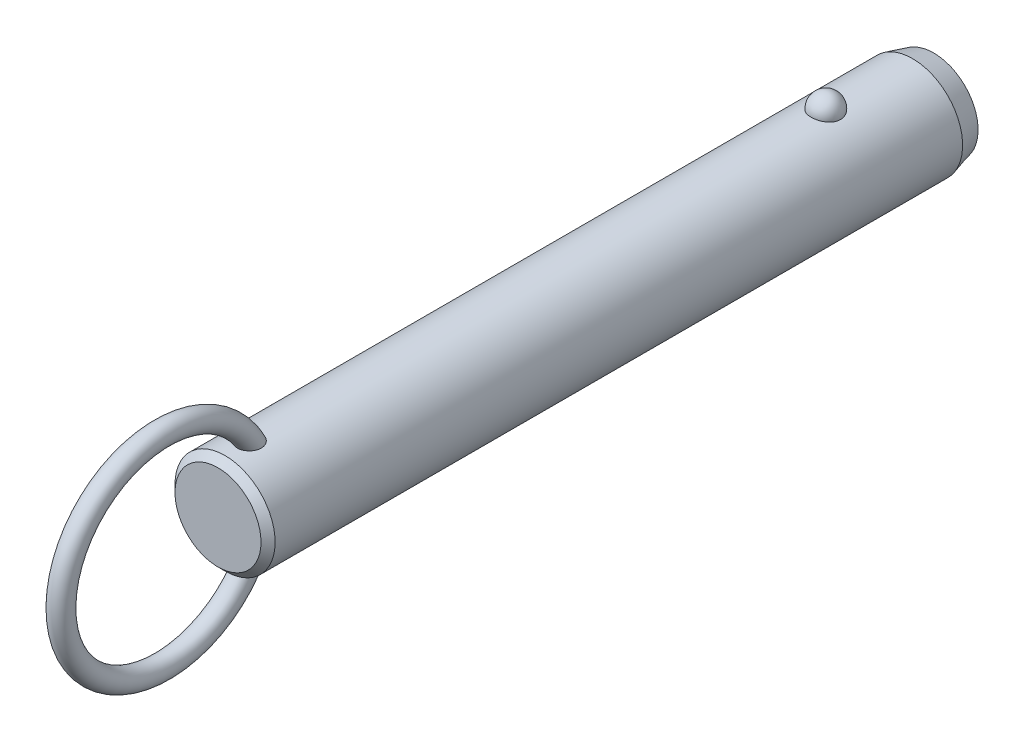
ISO-10303-21;
HEADER;
FILE_DESCRIPTION(('STEP AP214'),'2;1');
FILE_NAME('part.step','',(''),(''),'','','');
FILE_SCHEMA(('AUTOMOTIVE_DESIGN { 1 0 10303 214 1 1 1 1 }'));
ENDSEC;
DATA;
#1=APPLICATION_CONTEXT('core data for automotive mechanical design processes');
#2=APPLICATION_PROTOCOL_DEFINITION('international standard','automotive_design',2000,#1);
#3=PRODUCT_CONTEXT('',#1,'mechanical');
#4=PRODUCT('Part','Part','',(#3));
#5=PRODUCT_RELATED_PRODUCT_CATEGORY('part','',(#4));
#6=PRODUCT_DEFINITION_FORMATION('','',#4);
#7=PRODUCT_DEFINITION_CONTEXT('part definition',#1,'design');
#8=PRODUCT_DEFINITION('design','',#6,#7);
#9=PRODUCT_DEFINITION_SHAPE('','',#8);
#10=(LENGTH_UNIT() NAMED_UNIT(*) SI_UNIT(.MILLI.,.METRE.));
#11=(NAMED_UNIT(*) PLANE_ANGLE_UNIT() SI_UNIT($,.RADIAN.));
#12=(NAMED_UNIT(*) SI_UNIT($,.STERADIAN.) SOLID_ANGLE_UNIT());
#13=UNCERTAINTY_MEASURE_WITH_UNIT(LENGTH_MEASURE(1.E-05),#10,'distance_accuracy_value','');
#14=(GEOMETRIC_REPRESENTATION_CONTEXT(3) GLOBAL_UNCERTAINTY_ASSIGNED_CONTEXT((#13)) GLOBAL_UNIT_ASSIGNED_CONTEXT((#10,
#11,#12)) REPRESENTATION_CONTEXT('',''));
#15=CARTESIAN_POINT('',(0.,0.,0.));
#16=DIRECTION('',(0.,0.,1.));
#17=DIRECTION('',(1.,0.,0.));
#18=AXIS2_PLACEMENT_3D('',#15,#16,#17);
#19=CARTESIAN_POINT('',(0.,0.,76.2));
#20=DIRECTION('',(0.,0.,-1.));
#21=DIRECTION('',(-1.,0.,0.));
#22=AXIS2_PLACEMENT_3D('',#19,#20,#21);
#23=CYLINDRICAL_SURFACE('',#22,7.1);
#24=CARTESIAN_POINT('',(2.0769088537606,6.78943661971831,-2.1));
#25=CARTESIAN_POINT('',(2.07690739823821,6.78943796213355,-1.98268154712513));
#26=CARTESIAN_POINT('',(2.06738130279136,6.79237331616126,-1.86534506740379));
#27=CARTESIAN_POINT('',(2.0295040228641,6.8037853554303,-1.63400788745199));
#28=CARTESIAN_POINT('',(2.00114757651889,6.81226358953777,-1.52000812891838));
#29=CARTESIAN_POINT('',(1.92632025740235,6.83379798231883,-1.29863433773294));
#30=CARTESIAN_POINT('',(1.87985726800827,6.84685214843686,-1.19125744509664));
#31=CARTESIAN_POINT('',(1.76995205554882,6.87608091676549,-0.986046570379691));
#32=CARTESIAN_POINT('',(1.70650980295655,6.8922555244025,-0.888212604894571));
#33=CARTESIAN_POINT('',(1.56381192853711,6.92602930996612,-0.704242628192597));
#34=CARTESIAN_POINT('',(1.4844714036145,6.94363582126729,-0.618173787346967));
#35=CARTESIAN_POINT('',(1.31221746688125,6.97823658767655,-0.460740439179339));
#36=CARTESIAN_POINT('',(1.21930409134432,6.99523084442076,-0.389375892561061));
#37=CARTESIAN_POINT('',(1.02268781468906,7.02666176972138,-0.263547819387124));
#38=CARTESIAN_POINT('',(0.919020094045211,7.04110638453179,-0.209031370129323));
#39=CARTESIAN_POINT('',(0.703548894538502,7.06588726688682,-0.118163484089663));
#40=CARTESIAN_POINT('',(0.591746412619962,7.07622403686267,-0.0818098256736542));
#41=CARTESIAN_POINT('',(0.365557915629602,7.09147068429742,-0.028871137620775));
#42=CARTESIAN_POINT('',(0.251267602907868,7.09648447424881,-0.0119070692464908));
#43=CARTESIAN_POINT('',(0.0213499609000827,7.10089837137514,0.00304925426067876));
#44=CARTESIAN_POINT('',(-0.0942772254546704,7.10029907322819,0.00104351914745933));
#45=CARTESIAN_POINT('',(-0.321651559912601,7.09360829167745,-0.0216931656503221));
#46=CARTESIAN_POINT('',(-0.433431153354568,7.08760388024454,-0.0421272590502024));
#47=CARTESIAN_POINT('',(-0.651862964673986,7.07086131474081,-0.100729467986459));
#48=CARTESIAN_POINT('',(-0.758515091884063,7.06012307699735,-0.138897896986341));
#49=CARTESIAN_POINT('',(-0.964449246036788,7.03496097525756,-0.232213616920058));
#50=CARTESIAN_POINT('',(-1.06368095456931,7.02051445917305,-0.287465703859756));
#51=CARTESIAN_POINT('',(-1.25145353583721,6.98948740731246,-0.413383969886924));
#52=CARTESIAN_POINT('',(-1.33999321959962,6.97290663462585,-0.484051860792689));
#53=CARTESIAN_POINT('',(-1.50591604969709,6.93898770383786,-0.640594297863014));
#54=CARTESIAN_POINT('',(-1.58302488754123,6.92164094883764,-0.726757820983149));
#55=CARTESIAN_POINT('',(-1.72189320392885,6.8884103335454,-0.910927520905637));
#56=CARTESIAN_POINT('',(-1.78365144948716,6.87252659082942,-1.008934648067));
#57=CARTESIAN_POINT('',(-1.89101272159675,6.84377189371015,-1.21549497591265));
#58=CARTESIAN_POINT('',(-1.93639553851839,6.83094274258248,-1.32416860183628));
#59=CARTESIAN_POINT('',(-2.00874275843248,6.81002070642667,-1.54791500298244));
#60=CARTESIAN_POINT('',(-2.03570774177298,6.80192767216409,-1.66298757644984));
#61=CARTESIAN_POINT('',(-2.07047276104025,6.7914266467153,-1.89571453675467));
#62=CARTESIAN_POINT('',(-2.07835878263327,6.78899315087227,-2.01335491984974));
#63=CARTESIAN_POINT('',(-2.07502083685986,6.79001409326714,-2.24833570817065));
#64=CARTESIAN_POINT('',(-2.06379746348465,6.7934683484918,-2.36567612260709));
#65=CARTESIAN_POINT('',(-2.02263913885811,6.80583442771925,-2.59603194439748));
#66=CARTESIAN_POINT('',(-1.99281127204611,6.81471501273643,-2.70906820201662));
#67=CARTESIAN_POINT('',(-1.91526639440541,6.83691232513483,-2.92836575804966));
#68=CARTESIAN_POINT('',(-1.8675486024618,6.85022924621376,-3.03462676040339));
#69=CARTESIAN_POINT('',(-1.75504492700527,6.87991336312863,-3.23806487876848));
#70=CARTESIAN_POINT('',(-1.69015924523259,6.89629822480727,-3.33518422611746));
#71=CARTESIAN_POINT('',(-1.54505404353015,6.93024852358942,-3.51697105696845));
#72=CARTESIAN_POINT('',(-1.46483385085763,6.94781401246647,-3.60163799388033));
#73=CARTESIAN_POINT('',(-1.29071406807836,6.98225977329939,-3.75654119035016));
#74=CARTESIAN_POINT('',(-1.19675650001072,6.99913673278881,-3.82671308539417));
#75=CARTESIAN_POINT('',(-0.997940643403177,7.03023618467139,-3.9501837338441));
#76=CARTESIAN_POINT('',(-0.893083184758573,7.04445887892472,-4.00348377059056));
#77=CARTESIAN_POINT('',(-0.676902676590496,7.06848365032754,-4.09107242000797));
#78=CARTESIAN_POINT('',(-0.565686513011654,7.0783430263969,-4.12560889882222));
#79=CARTESIAN_POINT('',(-0.338739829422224,7.09282534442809,-4.17575450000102));
#80=CARTESIAN_POINT('',(-0.223009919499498,7.09744899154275,-4.19136617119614));
#81=CARTESIAN_POINT('',(0.00707628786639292,7.10090930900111,-4.20307965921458));
#82=CARTESIAN_POINT('',(0.121410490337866,7.09986531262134,-4.19958377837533));
#83=CARTESIAN_POINT('',(0.34781544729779,7.092380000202,-4.17411564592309));
#84=CARTESIAN_POINT('',(0.459886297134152,7.08593891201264,-4.15214417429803));
#85=CARTESIAN_POINT('',(0.678084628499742,7.06838983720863,-4.09049562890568));
#86=CARTESIAN_POINT('',(0.784237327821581,7.05730369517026,-4.05090137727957));
#87=CARTESIAN_POINT('',(0.988305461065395,7.03163139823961,-3.95511447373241));
#88=CARTESIAN_POINT('',(1.08622031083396,7.01704499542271,-3.89892064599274));
#89=CARTESIAN_POINT('',(1.27284490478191,6.98562668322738,-3.77035541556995));
#90=CARTESIAN_POINT('',(1.36137372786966,6.96876135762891,-3.69772964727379));
#91=CARTESIAN_POINT('',(1.52509486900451,6.93477412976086,-3.53878279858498));
#92=CARTESIAN_POINT('',(1.60028496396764,6.91765218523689,-3.45245943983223));
#93=CARTESIAN_POINT('',(1.73681688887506,6.88465753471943,-3.26658774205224));
#94=CARTESIAN_POINT('',(1.79785966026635,6.86881574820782,-3.16681408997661));
#95=CARTESIAN_POINT('',(1.90265327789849,6.84053157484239,-2.95814408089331));
#96=CARTESIAN_POINT('',(1.94640861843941,6.82808830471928,-2.84925010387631));
#97=CARTESIAN_POINT('',(2.01274378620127,6.80881460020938,-2.63454318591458));
#98=CARTESIAN_POINT('',(2.03676193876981,6.80160856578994,-2.52920574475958));
#99=CARTESIAN_POINT('',(2.06884490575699,6.79191902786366,-2.3159172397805));
#100=CARTESIAN_POINT('',(2.07691019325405,6.78943538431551,-2.20796625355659));
#101=CARTESIAN_POINT('',(2.0769088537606,6.78943661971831,-2.1));
#102=B_SPLINE_CURVE_WITH_KNOTS('',3,(#24,#25,#26,#27,#28,#29,#30,#31,#32,#33,#34,#35,#36,#37,
#38,#39,#40,#41,#42,#43,#44,#45,#46,#47,#48,#49,#50,#51,#52,#53,#54,#55,#56,#57,#58,#59,#60,#61,
#62,#63,#64,#65,#66,#67,#68,#69,#70,#71,#72,#73,#74,#75,#76,#77,#78,#79,#80,#81,#82,#83,#84,#85,
#86,#87,#88,#89,#90,#91,#92,#93,#94,#95,#96,#97,#98,#99,#100,#101),.UNSPECIFIED.,.T.,.F.,(4,2,2,
2,2,2,2,2,2,2,2,2,2,2,2,2,2,2,2,2,2,2,2,2,2,2,2,2,2,2,2,2,2,2,2,2,2,2,4),(0.,0.351568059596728,
0.703234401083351,1.05474780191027,1.40626181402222,1.75970563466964,2.11314851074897,
2.4654696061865,2.81774759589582,3.16301449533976,3.50824481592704,3.84801136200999,
4.18778391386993,4.52968352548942,4.87162112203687,5.22076181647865,5.56993054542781,
5.92363364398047,6.27732559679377,6.62942052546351,6.98150450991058,7.33158042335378,
7.68167162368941,8.03384443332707,8.38603269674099,8.73975272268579,9.09344583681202,
9.44234545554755,9.79119807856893,10.1327344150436,10.4742563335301,10.8141898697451,
11.1541474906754,11.4997793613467,11.8454687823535,12.1979079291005,12.5502553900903,
12.8738073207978,13.1973496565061),.UNSPECIFIED.);
#103=CARTESIAN_POINT('',(2.0769088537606,6.78943661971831,-2.1));
#104=VERTEX_POINT('',#103);
#105=EDGE_CURVE('E41',#104,#104,#102,.T.);
#106=ORIENTED_EDGE('',*,*,#105,.T.);
#107=EDGE_LOOP('',(#106));
#108=FACE_BOUND('',#107,.T.);
#109=CARTESIAN_POINT('',(0.,0.,83.1200000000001));
#110=DIRECTION('',(0.,0.,1.));
#111=DIRECTION('',(1.,0.,0.));
#112=AXIS2_PLACEMENT_3D('',#109,#110,#111);
#113=CIRCLE('',#112,7.1);
#114=CARTESIAN_POINT('',(7.1,0.,83.1200000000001));
#115=VERTEX_POINT('',#114);
#116=EDGE_CURVE('E10',#115,#115,#113,.F.);
#117=ORIENTED_EDGE('',*,*,#116,.T.);
#118=EDGE_LOOP('',(#117));
#119=FACE_BOUND('',#118,.T.);
#120=CARTESIAN_POINT('',(-0.429539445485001,-7.08699541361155,77.9429212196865));
#121=CARTESIAN_POINT('',(-0.508331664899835,-7.08221999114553,77.9668764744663));
#122=CARTESIAN_POINT('',(-0.585039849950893,-7.07624016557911,77.9974570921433));
#123=CARTESIAN_POINT('',(-0.732082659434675,-7.06254296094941,78.0710242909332));
#124=CARTESIAN_POINT('',(-0.802417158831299,-7.05482554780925,78.1140111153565));
#125=CARTESIAN_POINT('',(-0.934722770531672,-7.03851844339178,78.2111135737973));
#126=CARTESIAN_POINT('',(-0.996700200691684,-7.02992941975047,78.2652207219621));
#127=CARTESIAN_POINT('',(-1.11079942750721,-7.01280697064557,78.3829676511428));
#128=CARTESIAN_POINT('',(-1.16292136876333,-7.00427354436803,78.4466072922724));
#129=CARTESIAN_POINT('',(-1.25705660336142,-6.98799959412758,78.5826870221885));
#130=CARTESIAN_POINT('',(-1.2988803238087,-6.98027525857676,78.6552598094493));
#131=CARTESIAN_POINT('',(-1.37069920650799,-6.96652886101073,78.8061686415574));
#132=CARTESIAN_POINT('',(-1.40069157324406,-6.96050720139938,78.8845060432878));
#133=CARTESIAN_POINT('',(-1.45043507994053,-6.95031881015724,79.0501903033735));
#134=CARTESIAN_POINT('',(-1.46937115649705,-6.94630231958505,79.1377897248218));
#135=CARTESIAN_POINT('',(-1.49424917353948,-6.94099239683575,79.3148714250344));
#136=CARTESIAN_POINT('',(-1.50018601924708,-6.93970003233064,79.4043544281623));
#137=CARTESIAN_POINT('',(-1.49978214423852,-6.93978815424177,79.5940607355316));
#138=CARTESIAN_POINT('',(-1.49187639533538,-6.94150934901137,79.694279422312));
#139=CARTESIAN_POINT('',(-1.46177925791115,-6.94790814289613,79.8924798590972));
#140=CARTESIAN_POINT('',(-1.43957541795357,-6.95258831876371,79.990459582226));
#141=CARTESIAN_POINT('',(-1.37783293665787,-6.96510647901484,80.1953629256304));
#142=CARTESIAN_POINT('',(-1.33634073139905,-6.97328848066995,80.3016801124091));
#143=CARTESIAN_POINT('',(-1.23686994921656,-6.99161706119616,80.5061777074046));
#144=CARTESIAN_POINT('',(-1.17889192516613,-7.00176357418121,80.6043583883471));
#145=CARTESIAN_POINT('',(-1.0587512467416,-7.02082898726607,80.7723743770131));
#146=CARTESIAN_POINT('',(-0.999247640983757,-7.02963746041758,80.8441230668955));
#147=CARTESIAN_POINT('',(-0.869494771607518,-7.04686074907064,80.9771959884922));
#148=CARTESIAN_POINT('',(-0.79926347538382,-7.05527619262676,81.0385372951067));
#149=CARTESIAN_POINT('',(-0.665408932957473,-7.06899457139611,81.1351316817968));
#150=CARTESIAN_POINT('',(-0.603817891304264,-7.07457275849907,81.1731512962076));
#151=CARTESIAN_POINT('',(-0.475172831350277,-7.08437420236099,81.2387581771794));
#152=CARTESIAN_POINT('',(-0.408123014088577,-7.08859848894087,81.2663533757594));
#153=CARTESIAN_POINT('',(-0.269431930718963,-7.09522749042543,81.3092569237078));
#154=CARTESIAN_POINT('',(-0.197757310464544,-7.09761688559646,81.3244618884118));
#155=CARTESIAN_POINT('',(-0.0527849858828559,-7.10017268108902,81.3407168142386));
#156=CARTESIAN_POINT('',(0.0205115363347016,-7.10034065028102,81.3417767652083));
#157=CARTESIAN_POINT('',(0.15642613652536,-7.09855986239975,81.3304619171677));
#158=CARTESIAN_POINT('',(0.219199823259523,-7.09688191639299,81.3198060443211));
#159=CARTESIAN_POINT('',(0.342134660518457,-7.09201880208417,81.2885379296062));
#160=CARTESIAN_POINT('',(0.402295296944,-7.08883333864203,81.2679237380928));
#161=CARTESIAN_POINT('',(0.520687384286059,-7.08113868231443,81.2172125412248));
#162=CARTESIAN_POINT('',(0.578791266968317,-7.07658958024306,81.1868272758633));
#163=CARTESIAN_POINT('',(0.690173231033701,-7.06659708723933,81.1183678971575));
#164=CARTESIAN_POINT('',(0.743447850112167,-7.061153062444,81.0802883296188));
#165=CARTESIAN_POINT('',(0.870947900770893,-7.04680292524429,80.9765929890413));
#166=CARTESIAN_POINT('',(0.941828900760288,-7.0375580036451,80.9068972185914));
#167=CARTESIAN_POINT('',(1.07136606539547,-7.01900793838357,80.7569450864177));
#168=CARTESIAN_POINT('',(1.13000013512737,-7.00970271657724,80.6766700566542));
#169=CARTESIAN_POINT('',(1.23579584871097,-6.99183327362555,80.5068997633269));
#170=CARTESIAN_POINT('',(1.28274271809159,-6.98328455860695,80.4172696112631));
#171=CARTESIAN_POINT('',(1.36351442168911,-6.96796352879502,80.2321763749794));
#172=CARTESIAN_POINT('',(1.39733971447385,-6.96119115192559,80.1367134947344));
#173=CARTESIAN_POINT('',(1.45579181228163,-6.94922464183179,79.9253092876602));
#174=CARTESIAN_POINT('',(1.47790145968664,-6.94449000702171,79.808631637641));
#175=CARTESIAN_POINT('',(1.50168752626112,-6.93938731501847,79.5730153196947));
#176=CARTESIAN_POINT('',(1.50336085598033,-6.93901991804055,79.4540763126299));
#177=CARTESIAN_POINT('',(1.48486516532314,-6.9430010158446,79.2236079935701));
#178=CARTESIAN_POINT('',(1.46573441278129,-6.9471253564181,79.1119958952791));
#179=CARTESIAN_POINT('',(1.40606892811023,-6.95944667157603,78.8948868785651));
#180=CARTESIAN_POINT('',(1.3655644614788,-6.96763788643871,78.7893815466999));
#181=CARTESIAN_POINT('',(1.27082700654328,-6.98548038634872,78.6042879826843));
#182=CARTESIAN_POINT('',(1.21949810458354,-6.99473841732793,78.5231719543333));
#183=CARTESIAN_POINT('',(1.10242050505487,-7.01414069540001,78.3722278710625));
#184=CARTESIAN_POINT('',(1.03668119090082,-7.02428436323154,78.3023925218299));
#185=CARTESIAN_POINT('',(0.900559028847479,-7.04295285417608,78.1835735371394));
#186=CARTESIAN_POINT('',(0.831428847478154,-7.05153466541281,78.1331573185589));
#187=CARTESIAN_POINT('',(0.685291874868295,-7.06723150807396,78.0451429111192));
#188=CARTESIAN_POINT('',(0.608287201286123,-7.0743469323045,78.0075412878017));
#189=CARTESIAN_POINT('',(0.451878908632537,-7.08602232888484,77.9474915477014));
#190=CARTESIAN_POINT('',(0.372686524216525,-7.09067127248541,77.9245088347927));
#191=CARTESIAN_POINT('',(0.211477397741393,-7.09730788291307,77.8920357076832));
#192=CARTESIAN_POINT('',(0.12946098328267,-7.09929585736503,77.8825437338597));
#193=CARTESIAN_POINT('',(-0.0332905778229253,-7.10037858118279,77.8773517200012));
#194=CARTESIAN_POINT('',(-0.114016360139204,-7.09953334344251,77.8813656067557));
#195=CARTESIAN_POINT('',(-0.273670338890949,-7.09517338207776,77.9024540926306));
#196=CARTESIAN_POINT('',(-0.352598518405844,-7.09165863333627,77.9195288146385));
#197=CARTESIAN_POINT('',(-0.429539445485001,-7.08699541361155,77.9429212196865));
#198=B_SPLINE_CURVE_WITH_KNOTS('',3,(#120,#121,#122,#123,#124,#125,#126,#127,#128,#129,#130,
#131,#132,#133,#134,#135,#136,#137,#138,#139,#140,#141,#142,#143,#144,#145,#146,#147,#148,#149,
#150,#151,#152,#153,#154,#155,#156,#157,#158,#159,#160,#161,#162,#163,#164,#165,#166,#167,#168,
#169,#170,#171,#172,#173,#174,#175,#176,#177,#178,#179,#180,#181,#182,#183,#184,#185,#186,#187,
#188,#189,#190,#191,#192,#193,#194,#195,#196,#197),.UNSPECIFIED.,.T.,.F.,(4,2,2,2,2,2,2,2,2,2,2,
2,2,2,2,2,2,2,2,2,2,2,2,2,2,2,2,2,2,2,2,2,2,2,2,2,2,2,4),(0.,0.247183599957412,0.49437204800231,
0.741372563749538,0.988369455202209,1.23962059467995,1.49093106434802,1.75897818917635,
2.02713035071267,2.32758265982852,2.62829697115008,2.97008736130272,3.31186629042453,
3.5917531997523,3.87117637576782,4.08813841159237,4.30493502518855,4.52352259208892,
4.74195577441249,4.93215328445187,5.12238804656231,5.31884850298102,5.51544871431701,
5.81332317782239,6.11173048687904,6.41527266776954,6.71880423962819,7.07358156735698,
7.42841252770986,7.76631485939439,8.10373999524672,8.39142246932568,8.67891817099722,
8.93560332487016,9.19221962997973,9.43881106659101,9.68537399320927,9.92674752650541,
10.1681233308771),.UNSPECIFIED.);
#199=CARTESIAN_POINT('',(-0.429539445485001,-7.08699541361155,77.9429212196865));
#200=VERTEX_POINT('',#199);
#201=EDGE_CURVE('E59',#200,#200,#198,.T.);
#202=ORIENTED_EDGE('',*,*,#201,.T.);
#203=EDGE_LOOP('',(#202));
#204=FACE_BOUND('',#203,.T.);
#205=CARTESIAN_POINT('',(-0.429539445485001,7.08699541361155,77.9429212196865));
#206=CARTESIAN_POINT('',(-0.351665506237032,7.09171429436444,77.9192469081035));
#207=CARTESIAN_POINT('',(-0.271733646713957,7.09525896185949,77.9020369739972));
#208=CARTESIAN_POINT('',(-0.110026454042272,7.09960839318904,77.8810059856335));
#209=CARTESIAN_POINT('',(-0.0282502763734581,7.10041187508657,77.877191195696));
#210=CARTESIAN_POINT('',(0.134782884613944,7.09918849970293,77.883059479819));
#211=CARTESIAN_POINT('',(0.216039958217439,7.09716214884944,77.8927401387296));
#212=CARTESIAN_POINT('',(0.375730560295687,7.09050177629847,77.9253471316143));
#213=CARTESIAN_POINT('',(0.454164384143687,7.08586802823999,77.9482720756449));
#214=CARTESIAN_POINT('',(0.606025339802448,7.07449911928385,78.006771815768));
#215=CARTESIAN_POINT('',(0.679451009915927,7.06776334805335,78.0423502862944));
#216=CARTESIAN_POINT('',(0.819234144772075,7.05292866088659,78.1251753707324));
#217=CARTESIAN_POINT('',(0.885591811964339,7.04482978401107,78.1724216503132));
#218=CARTESIAN_POINT('',(1.00993211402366,7.02808709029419,78.2775902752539));
#219=CARTESIAN_POINT('',(1.06785399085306,7.01943990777,78.335583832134));
#220=CARTESIAN_POINT('',(1.17342527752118,7.00256662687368,78.4603013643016));
#221=CARTESIAN_POINT('',(1.22107408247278,6.99434055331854,78.5270258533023));
#222=CARTESIAN_POINT('',(1.30652927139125,6.97889183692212,78.6693622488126));
#223=CARTESIAN_POINT('',(1.34399711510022,6.97170674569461,78.7451808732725));
#224=CARTESIAN_POINT('',(1.40682616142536,6.95930080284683,78.9018100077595));
#225=CARTESIAN_POINT('',(1.43218374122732,6.95408053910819,78.9826220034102));
#226=CARTESIAN_POINT('',(1.47246409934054,6.94566853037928,79.1535314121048));
#227=CARTESIAN_POINT('',(1.48642590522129,6.9426653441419,79.2438630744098));
#228=CARTESIAN_POINT('',(1.5011410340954,6.93949744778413,79.425619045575));
#229=CARTESIAN_POINT('',(1.50188917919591,6.93933385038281,79.5170437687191));
#230=CARTESIAN_POINT('',(1.49030464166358,6.94183245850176,79.7108438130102));
#231=CARTESIAN_POINT('',(1.47627413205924,6.94486147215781,79.813112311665));
#232=CARTESIAN_POINT('',(1.43356351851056,6.95380194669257,80.0144719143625));
#233=CARTESIAN_POINT('',(1.4048676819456,6.95971650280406,80.1135594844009));
#234=CARTESIAN_POINT('',(1.32908750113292,6.97461208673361,80.3189087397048));
#235=CARTESIAN_POINT('',(1.28011435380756,6.98388945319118,80.4244566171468));
#236=CARTESIAN_POINT('',(1.16520357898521,7.00397743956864,80.6257604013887));
#237=CARTESIAN_POINT('',(1.09927694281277,7.01478706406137,80.7215225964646));
#238=CARTESIAN_POINT('',(0.969361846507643,7.03373936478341,80.8767565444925));
#239=CARTESIAN_POINT('',(0.909042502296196,7.04187023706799,80.9393032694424));
#240=CARTESIAN_POINT('',(0.779178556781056,7.05741732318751,81.0540535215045));
#241=CARTESIAN_POINT('',(0.709649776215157,7.06483472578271,81.1062744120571));
#242=CARTESIAN_POINT('',(0.576854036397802,7.0767751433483,81.1881138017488));
#243=CARTESIAN_POINT('',(0.515118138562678,7.08158033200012,81.2201641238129));
#244=CARTESIAN_POINT('',(0.387127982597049,7.08972701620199,81.2737656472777));
#245=CARTESIAN_POINT('',(0.320877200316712,7.09306962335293,81.2953248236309));
#246=CARTESIAN_POINT('',(0.185041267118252,7.09791507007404,81.3264005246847));
#247=CARTESIAN_POINT('',(0.115437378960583,7.09940591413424,81.3358385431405));
#248=CARTESIAN_POINT('',(-0.0243157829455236,7.10030171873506,81.3415226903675));
#249=CARTESIAN_POINT('',(-0.0944648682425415,7.0997073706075,81.3377731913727));
#250=CARTESIAN_POINT('',(-0.225713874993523,7.09668414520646,81.3185081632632));
#251=CARTESIAN_POINT('',(-0.287006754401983,7.09444865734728,81.3042323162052));
#252=CARTESIAN_POINT('',(-0.40655537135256,7.08860360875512,81.2663685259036));
#253=CARTESIAN_POINT('',(-0.464809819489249,7.08499346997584,81.2427766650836));
#254=CARTESIAN_POINT('',(-0.594955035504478,7.07541654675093,81.1789232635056));
#255=CARTESIAN_POINT('',(-0.665389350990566,7.06906574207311,81.135753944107));
#256=CARTESIAN_POINT('',(-0.798242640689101,7.05530261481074,81.038587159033));
#257=CARTESIAN_POINT('',(-0.860645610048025,7.0478882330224,80.9845686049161));
#258=CARTESIAN_POINT('',(-0.994249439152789,7.03045217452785,80.8509965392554));
#259=CARTESIAN_POINT('',(-1.06260129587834,7.02030745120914,80.7686143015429));
#260=CARTESIAN_POINT('',(-1.18502045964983,7.00068382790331,80.593843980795));
#261=CARTESIAN_POINT('',(-1.23907684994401,6.99120544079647,80.501448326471));
#262=CARTESIAN_POINT('',(-1.33335589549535,6.97384343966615,80.3080085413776));
#263=CARTESIAN_POINT('',(-1.3733613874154,6.96598557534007,80.2068564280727));
#264=CARTESIAN_POINT('',(-1.43770677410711,6.9529905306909,79.9995046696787));
#265=CARTESIAN_POINT('',(-1.46204473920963,6.94785368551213,79.89330440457));
#266=CARTESIAN_POINT('',(-1.49537533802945,6.94076296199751,79.6682317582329));
#267=CARTESIAN_POINT('',(-1.50273564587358,6.93914842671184,79.5490975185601));
#268=CARTESIAN_POINT('',(-1.4954555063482,6.94072368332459,79.3114703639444));
#269=CARTESIAN_POINT('',(-1.48082914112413,6.94391040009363,79.1929770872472));
#270=CARTESIAN_POINT('',(-1.43076401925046,6.95438579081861,78.9734325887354));
#271=CARTESIAN_POINT('',(-1.39762227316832,6.96121852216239,78.8718413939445));
#272=CARTESIAN_POINT('',(-1.31211274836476,6.97783941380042,78.6773513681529));
#273=CARTESIAN_POINT('',(-1.2597660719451,6.98762432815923,78.5844431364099));
#274=CARTESIAN_POINT('',(-1.14583073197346,7.00713153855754,78.4241601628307));
#275=CARTESIAN_POINT('',(-1.0866594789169,7.01665982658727,78.3550351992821));
#276=CARTESIAN_POINT('',(-0.956606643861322,7.03556646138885,78.2288786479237));
#277=CARTESIAN_POINT('',(-0.88573712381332,7.04494495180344,78.1718347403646));
#278=CARTESIAN_POINT('',(-0.751558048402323,7.06035735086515,78.0831004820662));
#279=CARTESIAN_POINT('',(-0.690120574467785,7.0666695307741,78.0485932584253));
#280=CARTESIAN_POINT('',(-0.562815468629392,7.07794609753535,77.9887507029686));
#281=CARTESIAN_POINT('',(-0.496948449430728,7.08291067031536,77.9634141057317));
#282=CARTESIAN_POINT('',(-0.429539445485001,7.08699541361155,77.9429212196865));
#283=B_SPLINE_CURVE_WITH_KNOTS('',3,(#205,#206,#207,#208,#209,#210,#211,#212,#213,#214,#215,
#216,#217,#218,#219,#220,#221,#222,#223,#224,#225,#226,#227,#228,#229,#230,#231,#232,#233,#234,
#235,#236,#237,#238,#239,#240,#241,#242,#243,#244,#245,#246,#247,#248,#249,#250,#251,#252,#253,
#254,#255,#256,#257,#258,#259,#260,#261,#262,#263,#264,#265,#266,#267,#268,#269,#270,#271,#272,
#273,#274,#275,#276,#277,#278,#279,#280,#281,#282),.UNSPECIFIED.,.T.,.F.,(4,2,2,2,2,2,2,2,2,2,2,
2,2,2,2,2,2,2,2,2,2,2,2,2,2,2,2,2,2,2,2,2,2,2,2,2,2,2,4),(0.,0.244335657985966,
0.488785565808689,0.733191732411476,0.977572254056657,1.22202379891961,1.46646834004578,
1.71259457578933,1.95873529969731,2.21226768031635,2.46587585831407,2.73913816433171,
3.01250754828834,3.32109936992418,3.63002293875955,3.9786351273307,4.32702187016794,
4.58793945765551,4.84841449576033,5.05676704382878,5.26496096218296,5.47449661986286,
5.68396281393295,5.87205447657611,6.06022532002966,6.30743751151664,6.55513496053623,
6.87602468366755,7.19715875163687,7.52305774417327,7.84899686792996,8.20516155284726,
8.56109821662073,8.88040084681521,9.19935367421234,9.47236282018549,9.74509220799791,
9.95662250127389,10.1681235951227),.UNSPECIFIED.);
#284=CARTESIAN_POINT('',(-0.429539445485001,7.08699541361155,77.9429212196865));
#285=VERTEX_POINT('',#284);
#286=EDGE_CURVE('E66',#285,#285,#283,.T.);
#287=ORIENTED_EDGE('',*,*,#286,.T.);
#288=EDGE_LOOP('',(#287));
#289=FACE_BOUND('',#288,.T.);
#290=CARTESIAN_POINT('',(0.,0.,-14.4000000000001));
#291=DIRECTION('',(0.,0.,-1.));
#292=DIRECTION('',(-1.,0.,0.));
#293=AXIS2_PLACEMENT_3D('',#290,#291,#292);
#294=CIRCLE('',#293,7.1);
#295=CARTESIAN_POINT('',(-7.1,0.,-14.4000000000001));
#296=VERTEX_POINT('',#295);
#297=EDGE_CURVE('E56',#296,#296,#294,.F.);
#298=ORIENTED_EDGE('',*,*,#297,.T.);
#299=EDGE_LOOP('',(#298));
#300=FACE_BOUND('',#299,.T.);
#301=ADVANCED_FACE('F37',(#108,#119,#204,#289,#300),#23,.T.);
#302=CARTESIAN_POINT('',(0.,0.,-17.4));
#303=DIRECTION('',(0.,0.,-1.));
#304=DIRECTION('',(-1.,0.,0.));
#305=AXIS2_PLACEMENT_3D('',#302,#303,#304);
#306=PLANE('',#305);
#307=CARTESIAN_POINT('',(0.,0.,-17.4));
#308=DIRECTION('',(0.,0.,-1.));
#309=DIRECTION('',(-1.,0.,0.));
#310=AXIS2_PLACEMENT_3D('',#307,#308,#309);
#311=CIRCLE('',#310,6.29615242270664);
#312=CARTESIAN_POINT('',(-6.29615242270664,0.,-17.4));
#313=VERTEX_POINT('',#312);
#314=EDGE_CURVE('E65',#313,#313,#311,.T.);
#315=ORIENTED_EDGE('',*,*,#314,.T.);
#316=EDGE_LOOP('',(#315));
#317=FACE_BOUND('',#316,.T.);
#318=ADVANCED_FACE('F84',(#317),#306,.T.);
#319=CARTESIAN_POINT('',(0.,0.,-17.4));
#320=DIRECTION('',(0.,0.,1.));
#321=DIRECTION('',(1.,0.,0.));
#322=AXIS2_PLACEMENT_3D('',#319,#320,#321);
#323=CONICAL_SURFACE('',#322,6.29615242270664,0.261799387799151);
#324=ORIENTED_EDGE('',*,*,#297,.F.);
#325=EDGE_LOOP('',(#324));
#326=FACE_BOUND('',#325,.T.);
#327=ORIENTED_EDGE('',*,*,#314,.F.);
#328=EDGE_LOOP('',(#327));
#329=FACE_BOUND('',#328,.T.);
#330=ADVANCED_FACE('F82',(#326,#329),#323,.T.);
#331=CARTESIAN_POINT('',(0.,0.,84.12));
#332=DIRECTION('',(0.,0.,1.));
#333=DIRECTION('',(1.,0.,0.));
#334=AXIS2_PLACEMENT_3D('',#331,#332,#333);
#335=PLANE('',#334);
#336=CARTESIAN_POINT('',(0.,0.,84.12));
#337=DIRECTION('',(0.,0.,1.));
#338=DIRECTION('',(1.,0.,0.));
#339=AXIS2_PLACEMENT_3D('',#336,#337,#338);
#340=CIRCLE('',#339,6.10000000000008);
#341=CARTESIAN_POINT('',(6.10000000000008,0.,84.12));
#342=VERTEX_POINT('',#341);
#343=EDGE_CURVE('E50',#342,#342,#340,.T.);
#344=ORIENTED_EDGE('',*,*,#343,.T.);
#345=EDGE_LOOP('',(#344));
#346=FACE_BOUND('',#345,.T.);
#347=ADVANCED_FACE('F76',(#346),#335,.T.);
#348=CARTESIAN_POINT('',(0.,0.,92.05));
#349=DIRECTION('',(1.,0.,0.));
#350=DIRECTION('',(0.,0.,-1.));
#351=AXIS2_PLACEMENT_3D('',#348,#349,#350);
#352=TOROIDAL_SURFACE('',#351,14.35,1.5);
#353=ORIENTED_EDGE('',*,*,#286,.F.);
#354=EDGE_LOOP('',(#353));
#355=FACE_BOUND('',#354,.T.);
#356=ORIENTED_EDGE('',*,*,#201,.F.);
#357=EDGE_LOOP('',(#356));
#358=FACE_BOUND('',#357,.T.);
#359=ADVANCED_FACE('F72',(#355,#358),#352,.T.);
#360=CARTESIAN_POINT('',(0.,0.,84.12));
#361=DIRECTION('',(0.,0.,-1.));
#362=DIRECTION('',(-1.,0.,0.));
#363=AXIS2_PLACEMENT_3D('',#360,#361,#362);
#364=CONICAL_SURFACE('',#363,6.10000000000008,0.785398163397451);
#365=ORIENTED_EDGE('',*,*,#116,.F.);
#366=EDGE_LOOP('',(#365));
#367=FACE_BOUND('',#366,.T.);
#368=ORIENTED_EDGE('',*,*,#343,.F.);
#369=EDGE_LOOP('',(#368));
#370=FACE_BOUND('',#369,.T.);
#371=ADVANCED_FACE('F39',(#367,#370),#364,.T.);
#372=CARTESIAN_POINT('',(0.,7.1,-2.1));
#373=DIRECTION('',(0.,1.,0.));
#374=DIRECTION('',(0.,0.,1.));
#375=AXIS2_PLACEMENT_3D('',#372,#373,#374);
#376=SPHERICAL_SURFACE('',#375,2.10000000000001);
#377=ORIENTED_EDGE('',*,*,#105,.F.);
#378=EDGE_LOOP('',(#377));
#379=FACE_BOUND('',#378,.T.);
#380=ADVANCED_FACE('F78',(#379),#376,.T.);
#381=CLOSED_SHELL('',(#301,#318,#330,#347,#359,#371,#380));
#382=MANIFOLD_SOLID_BREP('B2',#381);
#383=ADVANCED_BREP_SHAPE_REPRESENTATION('',(#18,#382),#14);
#384=SHAPE_DEFINITION_REPRESENTATION(#9,#383);
ENDSEC;
END-ISO-10303-21;
